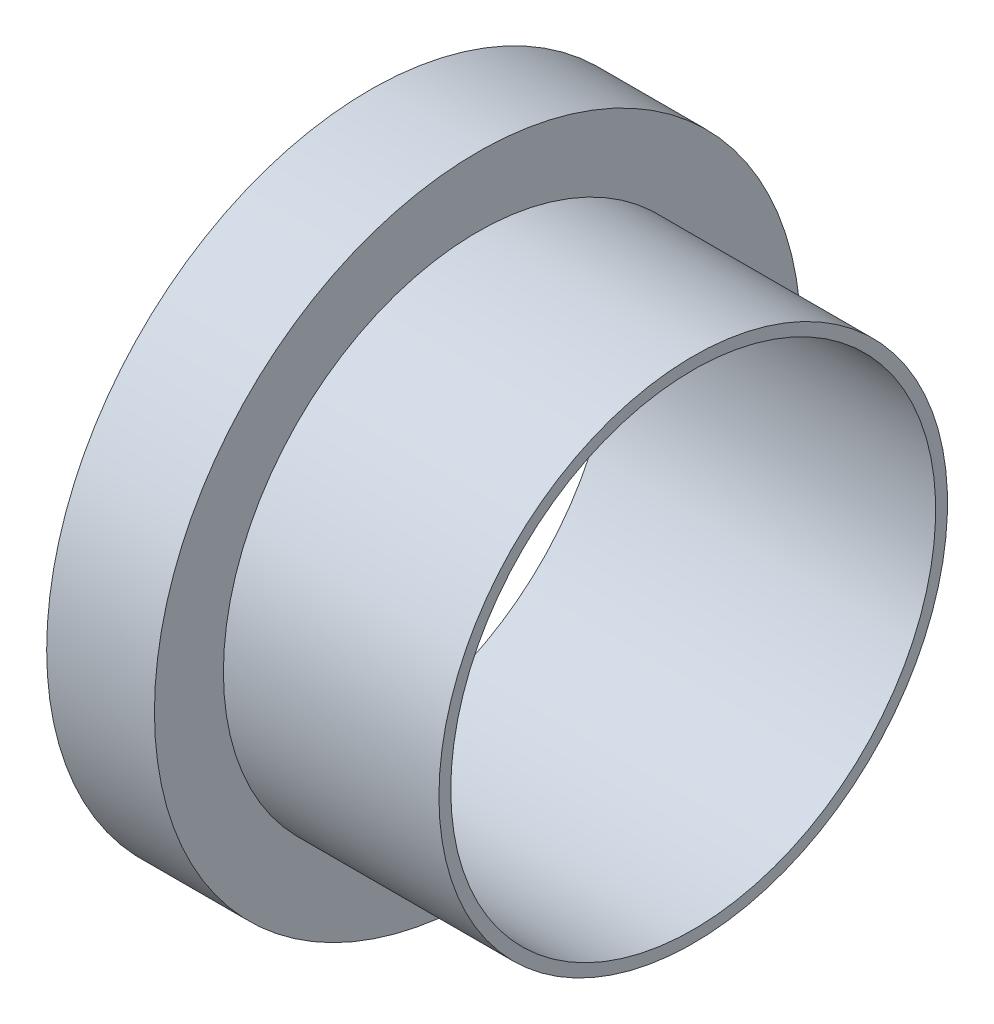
ISO-10303-21;
HEADER;
FILE_DESCRIPTION(('STEP AP214'),'2;1');
FILE_NAME('part.step','',(''),(''),'','','');
FILE_SCHEMA(('AUTOMOTIVE_DESIGN { 1 0 10303 214 1 1 1 1 }'));
ENDSEC;
DATA;
#1=APPLICATION_CONTEXT('core data for automotive mechanical design processes');
#2=APPLICATION_PROTOCOL_DEFINITION('international standard','automotive_design',2000,#1);
#3=PRODUCT_CONTEXT('',#1,'mechanical');
#4=PRODUCT('Part','Part','',(#3));
#5=PRODUCT_RELATED_PRODUCT_CATEGORY('part','',(#4));
#6=PRODUCT_DEFINITION_FORMATION('','',#4);
#7=PRODUCT_DEFINITION_CONTEXT('part definition',#1,'design');
#8=PRODUCT_DEFINITION('design','',#6,#7);
#9=PRODUCT_DEFINITION_SHAPE('','',#8);
#10=(LENGTH_UNIT() NAMED_UNIT(*) SI_UNIT(.MILLI.,.METRE.));
#11=(NAMED_UNIT(*) PLANE_ANGLE_UNIT() SI_UNIT($,.RADIAN.));
#12=(NAMED_UNIT(*) SI_UNIT($,.STERADIAN.) SOLID_ANGLE_UNIT());
#13=UNCERTAINTY_MEASURE_WITH_UNIT(LENGTH_MEASURE(1.E-05),#10,'distance_accuracy_value','');
#14=(GEOMETRIC_REPRESENTATION_CONTEXT(3) GLOBAL_UNCERTAINTY_ASSIGNED_CONTEXT((#13)) GLOBAL_UNIT_ASSIGNED_CONTEXT((#10,
#11,#12)) REPRESENTATION_CONTEXT('',''));
#15=CARTESIAN_POINT('',(0.,0.,0.));
#16=DIRECTION('',(0.,0.,1.));
#17=DIRECTION('',(1.,0.,0.));
#18=AXIS2_PLACEMENT_3D('',#15,#16,#17);
#19=CARTESIAN_POINT('',(0.,19.05,0.));
#20=DIRECTION('',(1.,0.,0.));
#21=DIRECTION('',(0.,0.,-1.));
#22=AXIS2_PLACEMENT_3D('',#19,#20,#21);
#23=PLANE('',#22);
#24=CARTESIAN_POINT('',(0.,0.,0.));
#25=DIRECTION('',(-1.,0.,0.));
#26=DIRECTION('',(0.,0.,1.));
#27=AXIS2_PLACEMENT_3D('',#24,#25,#26);
#28=CIRCLE('',#27,14.2875);
#29=CARTESIAN_POINT('',(0.,0.,14.2875));
#30=VERTEX_POINT('',#29);
#31=EDGE_CURVE('E10',#30,#30,#28,.T.);
#32=ORIENTED_EDGE('',*,*,#31,.F.);
#33=EDGE_LOOP('',(#32));
#34=FACE_BOUND('',#33,.T.);
#35=CARTESIAN_POINT('',(0.,0.,0.));
#36=DIRECTION('',(-1.,0.,0.));
#37=DIRECTION('',(0.,0.,1.));
#38=AXIS2_PLACEMENT_3D('',#35,#36,#37);
#39=CIRCLE('',#38,19.05);
#40=CARTESIAN_POINT('',(0.,0.,19.05));
#41=VERTEX_POINT('',#40);
#42=EDGE_CURVE('E53',#41,#41,#39,.T.);
#43=ORIENTED_EDGE('',*,*,#42,.T.);
#44=EDGE_LOOP('',(#43));
#45=FACE_BOUND('',#44,.T.);
#46=ADVANCED_FACE('F31',(#34,#45),#23,.F.);
#47=CARTESIAN_POINT('',(0.,0.,0.));
#48=DIRECTION('',(-1.,0.,0.));
#49=DIRECTION('',(0.,0.,1.));
#50=AXIS2_PLACEMENT_3D('',#47,#48,#49);
#51=CYLINDRICAL_SURFACE('',#50,14.2875);
#52=CARTESIAN_POINT('',(19.05,0.,0.));
#53=DIRECTION('',(-1.,0.,0.));
#54=DIRECTION('',(0.,0.,1.));
#55=AXIS2_PLACEMENT_3D('',#52,#53,#54);
#56=CIRCLE('',#55,14.2875);
#57=CARTESIAN_POINT('',(19.05,0.,14.2875));
#58=VERTEX_POINT('',#57);
#59=EDGE_CURVE('E37',#58,#58,#56,.T.);
#60=ORIENTED_EDGE('',*,*,#59,.F.);
#61=EDGE_LOOP('',(#60));
#62=FACE_BOUND('',#61,.T.);
#63=ORIENTED_EDGE('',*,*,#31,.T.);
#64=EDGE_LOOP('',(#63));
#65=FACE_BOUND('',#64,.T.);
#66=ADVANCED_FACE('F78',(#62,#65),#51,.F.);
#67=CARTESIAN_POINT('',(19.05,14.2875,0.));
#68=DIRECTION('',(-1.,0.,0.));
#69=DIRECTION('',(0.,0.,1.));
#70=AXIS2_PLACEMENT_3D('',#67,#68,#69);
#71=PLANE('',#70);
#72=CARTESIAN_POINT('',(19.05,0.,0.));
#73=DIRECTION('',(-1.,0.,0.));
#74=DIRECTION('',(0.,0.,1.));
#75=AXIS2_PLACEMENT_3D('',#72,#73,#74);
#76=CIRCLE('',#75,14.986);
#77=CARTESIAN_POINT('',(19.05,0.,14.986));
#78=VERTEX_POINT('',#77);
#79=EDGE_CURVE('E41',#78,#78,#76,.T.);
#80=ORIENTED_EDGE('',*,*,#79,.F.);
#81=EDGE_LOOP('',(#80));
#82=FACE_BOUND('',#81,.T.);
#83=ORIENTED_EDGE('',*,*,#59,.T.);
#84=EDGE_LOOP('',(#83));
#85=FACE_BOUND('',#84,.T.);
#86=ADVANCED_FACE('F73',(#82,#85),#71,.F.);
#87=CARTESIAN_POINT('',(0.,0.,0.));
#88=DIRECTION('',(-1.,0.,0.));
#89=DIRECTION('',(0.,0.,1.));
#90=AXIS2_PLACEMENT_3D('',#87,#88,#89);
#91=CYLINDRICAL_SURFACE('',#90,14.986);
#92=CARTESIAN_POINT('',(6.35,0.,0.));
#93=DIRECTION('',(-1.,0.,0.));
#94=DIRECTION('',(0.,0.,1.));
#95=AXIS2_PLACEMENT_3D('',#92,#93,#94);
#96=CIRCLE('',#95,14.986);
#97=CARTESIAN_POINT('',(6.35,0.,14.986));
#98=VERTEX_POINT('',#97);
#99=EDGE_CURVE('E45',#98,#98,#96,.T.);
#100=ORIENTED_EDGE('',*,*,#99,.F.);
#101=EDGE_LOOP('',(#100));
#102=FACE_BOUND('',#101,.T.);
#103=ORIENTED_EDGE('',*,*,#79,.T.);
#104=EDGE_LOOP('',(#103));
#105=FACE_BOUND('',#104,.T.);
#106=ADVANCED_FACE('F67',(#102,#105),#91,.T.);
#107=CARTESIAN_POINT('',(6.35,14.986,0.));
#108=DIRECTION('',(-1.,0.,0.));
#109=DIRECTION('',(0.,0.,1.));
#110=AXIS2_PLACEMENT_3D('',#107,#108,#109);
#111=PLANE('',#110);
#112=CARTESIAN_POINT('',(6.35,0.,0.));
#113=DIRECTION('',(-1.,0.,0.));
#114=DIRECTION('',(0.,0.,1.));
#115=AXIS2_PLACEMENT_3D('',#112,#113,#114);
#116=CIRCLE('',#115,19.05);
#117=CARTESIAN_POINT('',(6.35,0.,19.05));
#118=VERTEX_POINT('',#117);
#119=EDGE_CURVE('E50',#118,#118,#116,.T.);
#120=ORIENTED_EDGE('',*,*,#119,.F.);
#121=EDGE_LOOP('',(#120));
#122=FACE_BOUND('',#121,.T.);
#123=ORIENTED_EDGE('',*,*,#99,.T.);
#124=EDGE_LOOP('',(#123));
#125=FACE_BOUND('',#124,.T.);
#126=ADVANCED_FACE('F61',(#122,#125),#111,.F.);
#127=CARTESIAN_POINT('',(0.,0.,0.));
#128=DIRECTION('',(-1.,0.,0.));
#129=DIRECTION('',(0.,0.,1.));
#130=AXIS2_PLACEMENT_3D('',#127,#128,#129);
#131=CYLINDRICAL_SURFACE('',#130,19.05);
#132=ORIENTED_EDGE('',*,*,#42,.F.);
#133=EDGE_LOOP('',(#132));
#134=FACE_BOUND('',#133,.T.);
#135=ORIENTED_EDGE('',*,*,#119,.T.);
#136=EDGE_LOOP('',(#135));
#137=FACE_BOUND('',#136,.T.);
#138=ADVANCED_FACE('F58',(#134,#137),#131,.T.);
#139=CLOSED_SHELL('',(#46,#66,#86,#106,#126,#138));
#140=MANIFOLD_SOLID_BREP('B2',#139);
#141=ADVANCED_BREP_SHAPE_REPRESENTATION('',(#18,#140),#14);
#142=SHAPE_DEFINITION_REPRESENTATION(#9,#141);
ENDSEC;
END-ISO-10303-21;
